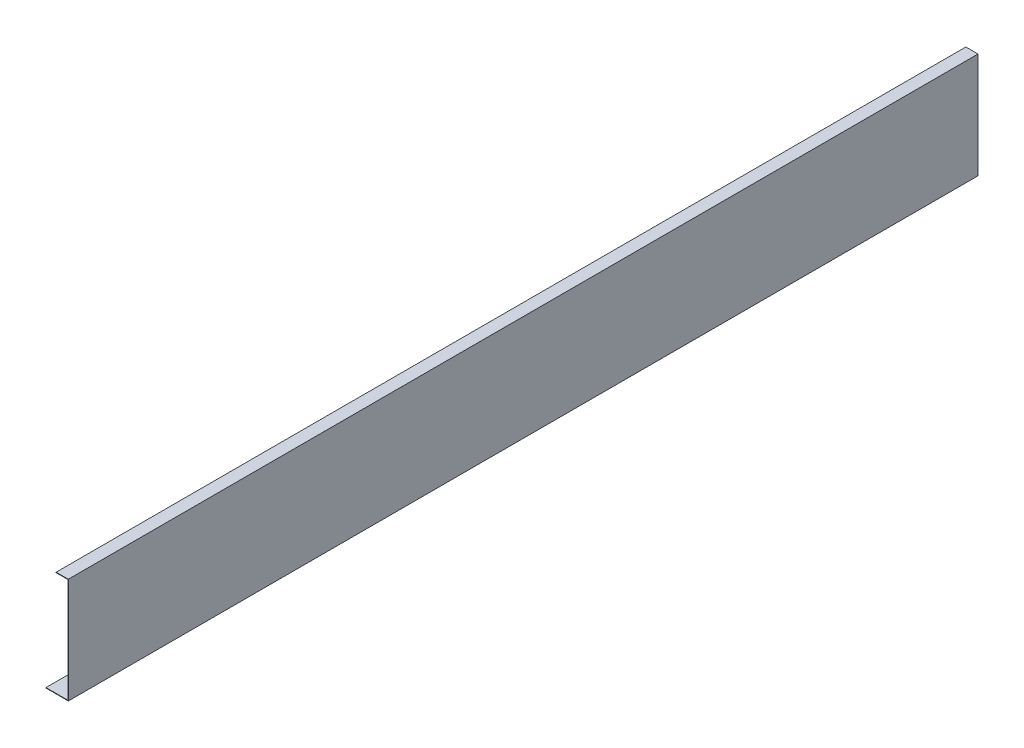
from build123d import *

# Parameters (mm, degrees)
BOSS_EXTRU_2_DEPTH      = 1121.02
ESQUISSE2_W             = 2.5
ESQUISSE2_H             = 32.5
ENL_V_MAT_EXTRU_1_DEPTH = 1129.931282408


with BuildPart() as part:
    # Esquisse1 → Boss.-Extru.2 (new body)
    with BuildSketch(Plane.XY):
        Polygon((0, 0), (30, 0), (30, 130), (15, 130), (15, 129.35), (29.35, 129.35), (29.35, 0.65), (0.65, 0.65), (0.65, 20), (0, 20), align=None)
    extrude(amount=BOSS_EXTRU_2_DEPTH)

    # Esquisse2 → Enl_v. mat.-Extru.1 (cut, through all)
    with BuildSketch(Plane.XZ):
        with Locations((1.25, 1104.77)):
            Rectangle(ESQUISSE2_W, ESQUISSE2_H)
        with Locations((1.25, 16.25)):
            Rectangle(ESQUISSE2_W, ESQUISSE2_H)
    extrude(amount=-ENL_V_MAT_EXTRU_1_DEPTH, mode=Mode.SUBTRACT)


solid = part.part
